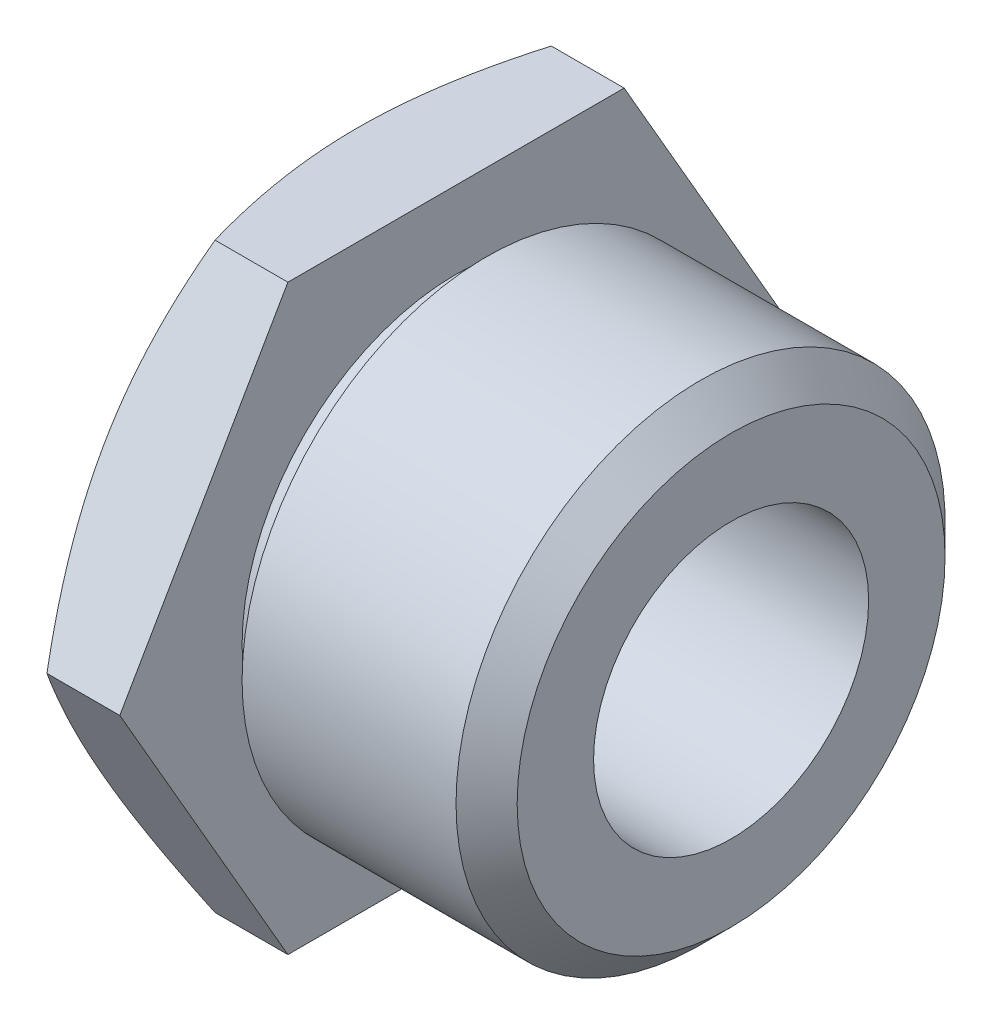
ISO-10303-21;
HEADER;
FILE_DESCRIPTION(('STEP AP214'),'2;1');
FILE_NAME('part.step','',(''),(''),'','','');
FILE_SCHEMA(('AUTOMOTIVE_DESIGN { 1 0 10303 214 1 1 1 1 }'));
ENDSEC;
DATA;
#1=APPLICATION_CONTEXT('core data for automotive mechanical design processes');
#2=APPLICATION_PROTOCOL_DEFINITION('international standard','automotive_design',2000,#1);
#3=PRODUCT_CONTEXT('',#1,'mechanical');
#4=PRODUCT('Part','Part','',(#3));
#5=PRODUCT_RELATED_PRODUCT_CATEGORY('part','',(#4));
#6=PRODUCT_DEFINITION_FORMATION('','',#4);
#7=PRODUCT_DEFINITION_CONTEXT('part definition',#1,'design');
#8=PRODUCT_DEFINITION('design','',#6,#7);
#9=PRODUCT_DEFINITION_SHAPE('','',#8);
#10=(LENGTH_UNIT() NAMED_UNIT(*) SI_UNIT(.MILLI.,.METRE.));
#11=(NAMED_UNIT(*) PLANE_ANGLE_UNIT() SI_UNIT($,.RADIAN.));
#12=(NAMED_UNIT(*) SI_UNIT($,.STERADIAN.) SOLID_ANGLE_UNIT());
#13=UNCERTAINTY_MEASURE_WITH_UNIT(LENGTH_MEASURE(1.E-05),#10,'distance_accuracy_value','');
#14=(GEOMETRIC_REPRESENTATION_CONTEXT(3) GLOBAL_UNCERTAINTY_ASSIGNED_CONTEXT((#13)) GLOBAL_UNIT_ASSIGNED_CONTEXT((#10,
#11,#12)) REPRESENTATION_CONTEXT('',''));
#15=CARTESIAN_POINT('',(0.,0.,0.));
#16=DIRECTION('',(0.,0.,1.));
#17=DIRECTION('',(1.,0.,0.));
#18=AXIS2_PLACEMENT_3D('',#15,#16,#17);
#19=CARTESIAN_POINT('',(0.,0.,0.));
#20=DIRECTION('',(-1.,0.,0.));
#21=DIRECTION('',(0.,0.,1.));
#22=AXIS2_PLACEMENT_3D('',#19,#20,#21);
#23=CYLINDRICAL_SURFACE('',#22,14.);
#24=CARTESIAN_POINT('',(0.,0.,0.));
#25=DIRECTION('',(-1.,0.,0.));
#26=DIRECTION('',(0.,0.,1.));
#27=AXIS2_PLACEMENT_3D('',#24,#25,#26);
#28=CIRCLE('',#27,14.);
#29=CARTESIAN_POINT('',(0.,0.,14.));
#30=VERTEX_POINT('',#29);
#31=EDGE_CURVE('E448',#30,#30,#28,.T.);
#32=ORIENTED_EDGE('',*,*,#31,.F.);
#33=EDGE_LOOP('',(#32));
#34=FACE_BOUND('',#33,.T.);
#35=CARTESIAN_POINT('',(2.,0.,0.));
#36=DIRECTION('',(-1.,0.,0.));
#37=DIRECTION('',(0.,0.,1.));
#38=AXIS2_PLACEMENT_3D('',#35,#36,#37);
#39=CIRCLE('',#38,14.);
#40=CARTESIAN_POINT('',(2.,0.,14.));
#41=VERTEX_POINT('',#40);
#42=EDGE_CURVE('E445',#41,#41,#39,.T.);
#43=ORIENTED_EDGE('',*,*,#42,.T.);
#44=EDGE_LOOP('',(#43));
#45=FACE_BOUND('',#44,.T.);
#46=ADVANCED_FACE('F352',(#34,#45),#23,.T.);
#47=CARTESIAN_POINT('',(2.,14.,0.));
#48=DIRECTION('',(1.,0.,0.));
#49=DIRECTION('',(0.,0.,-1.));
#50=AXIS2_PLACEMENT_3D('',#47,#48,#49);
#51=PLANE('',#50);
#52=ORIENTED_EDGE('',*,*,#42,.F.);
#53=EDGE_LOOP('',(#52));
#54=FACE_BOUND('',#53,.T.);
#55=CARTESIAN_POINT('',(2.,0.,0.));
#56=DIRECTION('',(-1.,0.,0.));
#57=DIRECTION('',(0.,0.,1.));
#58=AXIS2_PLACEMENT_3D('',#55,#56,#57);
#59=CIRCLE('',#58,16.);
#60=CARTESIAN_POINT('',(2.,0.,16.));
#61=VERTEX_POINT('',#60);
#62=EDGE_CURVE('E442',#61,#61,#59,.T.);
#63=ORIENTED_EDGE('',*,*,#62,.T.);
#64=EDGE_LOOP('',(#63));
#65=FACE_BOUND('',#64,.T.);
#66=ADVANCED_FACE('F470',(#54,#65),#51,.F.);
#67=CARTESIAN_POINT('',(0.,0.,0.));
#68=DIRECTION('',(-1.,0.,0.));
#69=DIRECTION('',(0.,0.,1.));
#70=AXIS2_PLACEMENT_3D('',#67,#68,#69);
#71=CYLINDRICAL_SURFACE('',#70,16.);
#72=CARTESIAN_POINT('',(16.,0.,0.));
#73=DIRECTION('',(-1.,0.,0.));
#74=DIRECTION('',(0.,0.,1.));
#75=AXIS2_PLACEMENT_3D('',#72,#73,#74);
#76=CIRCLE('',#75,16.);
#77=CARTESIAN_POINT('',(16.,0.,16.));
#78=VERTEX_POINT('',#77);
#79=EDGE_CURVE('E451',#78,#78,#76,.T.);
#80=ORIENTED_EDGE('',*,*,#79,.T.);
#81=EDGE_LOOP('',(#80));
#82=FACE_BOUND('',#81,.T.);
#83=ORIENTED_EDGE('',*,*,#62,.F.);
#84=EDGE_LOOP('',(#83));
#85=FACE_BOUND('',#84,.T.);
#86=ADVANCED_FACE('F467',(#82,#85),#71,.T.);
#87=CARTESIAN_POINT('',(18.,16.,0.));
#88=DIRECTION('',(-1.,0.,0.));
#89=DIRECTION('',(0.,0.,1.));
#90=AXIS2_PLACEMENT_3D('',#87,#88,#89);
#91=PLANE('',#90);
#92=CARTESIAN_POINT('',(18.,0.,0.));
#93=DIRECTION('',(-1.,0.,0.));
#94=DIRECTION('',(0.,0.,1.));
#95=AXIS2_PLACEMENT_3D('',#92,#93,#94);
#96=CIRCLE('',#95,14.);
#97=CARTESIAN_POINT('',(18.,0.,14.));
#98=VERTEX_POINT('',#97);
#99=EDGE_CURVE('E364',#98,#98,#96,.F.);
#100=ORIENTED_EDGE('',*,*,#99,.T.);
#101=EDGE_LOOP('',(#100));
#102=FACE_BOUND('',#101,.T.);
#103=CARTESIAN_POINT('',(18.,0.,0.));
#104=DIRECTION('',(-1.,0.,0.));
#105=DIRECTION('',(0.,0.,1.));
#106=AXIS2_PLACEMENT_3D('',#103,#104,#105);
#107=CIRCLE('',#106,9.);
#108=CARTESIAN_POINT('',(18.,0.,9.));
#109=VERTEX_POINT('',#108);
#110=EDGE_CURVE('E439',#109,#109,#107,.T.);
#111=ORIENTED_EDGE('',*,*,#110,.T.);
#112=EDGE_LOOP('',(#111));
#113=FACE_BOUND('',#112,.T.);
#114=ADVANCED_FACE('F456',(#102,#113),#91,.F.);
#115=CARTESIAN_POINT('',(0.,0.,0.));
#116=DIRECTION('',(-1.,0.,0.));
#117=DIRECTION('',(0.,0.,1.));
#118=AXIS2_PLACEMENT_3D('',#115,#116,#117);
#119=CYLINDRICAL_SURFACE('',#118,9.);
#120=ORIENTED_EDGE('',*,*,#110,.F.);
#121=EDGE_LOOP('',(#120));
#122=FACE_BOUND('',#121,.T.);
#123=CARTESIAN_POINT('',(-6.5,0.,0.));
#124=DIRECTION('',(-1.,0.,0.));
#125=DIRECTION('',(0.,0.,1.));
#126=AXIS2_PLACEMENT_3D('',#123,#124,#125);
#127=CIRCLE('',#126,9.);
#128=CARTESIAN_POINT('',(-6.5,0.,9.));
#129=VERTEX_POINT('',#128);
#130=EDGE_CURVE('E502',#129,#129,#127,.T.);
#131=ORIENTED_EDGE('',*,*,#130,.T.);
#132=EDGE_LOOP('',(#131));
#133=FACE_BOUND('',#132,.T.);
#134=ADVANCED_FACE('F463',(#122,#133),#119,.F.);
#135=CARTESIAN_POINT('',(16.,0.,0.));
#136=DIRECTION('',(-1.,0.,0.));
#137=DIRECTION('',(0.,0.,1.));
#138=AXIS2_PLACEMENT_3D('',#135,#136,#137);
#139=CONICAL_SURFACE('',#138,16.,0.785398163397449);
#140=ORIENTED_EDGE('',*,*,#99,.F.);
#141=EDGE_LOOP('',(#140));
#142=FACE_BOUND('',#141,.T.);
#143=ORIENTED_EDGE('',*,*,#79,.F.);
#144=EDGE_LOOP('',(#143));
#145=FACE_BOUND('',#144,.T.);
#146=ADVANCED_FACE('F459',(#142,#145),#139,.T.);
#147=CARTESIAN_POINT('',(0.,-19.0525588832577,11.));
#148=DIRECTION('',(1.,0.,0.));
#149=DIRECTION('',(0.,0.,-1.));
#150=AXIS2_PLACEMENT_3D('',#147,#148,#149);
#151=PLANE('',#150);
#152=DIRECTION('',(0.,0.866025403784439,0.5));
#153=VECTOR('',#152,1.);
#154=CARTESIAN_POINT('',(0.,-19.0525588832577,11.));
#155=LINE('',#154,#153);
#156=CARTESIAN_POINT('',(0.,-19.0525588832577,11.));
#157=VERTEX_POINT('',#156);
#158=CARTESIAN_POINT('',(0.,0.,22.));
#159=VERTEX_POINT('',#158);
#160=EDGE_CURVE('E555',#157,#159,#155,.T.);
#161=ORIENTED_EDGE('',*,*,#160,.F.);
#162=DIRECTION('',(0.,0.,1.));
#163=VECTOR('',#162,1.);
#164=CARTESIAN_POINT('',(0.,-19.0525588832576,-11.));
#165=LINE('',#164,#163);
#166=CARTESIAN_POINT('',(0.,-19.0525588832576,-11.));
#167=VERTEX_POINT('',#166);
#168=EDGE_CURVE('E568',#167,#157,#165,.T.);
#169=ORIENTED_EDGE('',*,*,#168,.F.);
#170=DIRECTION('',(0.,-0.866025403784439,0.5));
#171=VECTOR('',#170,1.);
#172=CARTESIAN_POINT('',(0.,0.,-22.));
#173=LINE('',#172,#171);
#174=CARTESIAN_POINT('',(0.,0.,-22.));
#175=VERTEX_POINT('',#174);
#176=EDGE_CURVE('E566',#175,#167,#173,.T.);
#177=ORIENTED_EDGE('',*,*,#176,.F.);
#178=DIRECTION('',(0.,-0.866025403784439,-0.5));
#179=VECTOR('',#178,1.);
#180=CARTESIAN_POINT('',(0.,19.0525588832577,-11.));
#181=LINE('',#180,#179);
#182=CARTESIAN_POINT('',(0.,19.0525588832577,-11.));
#183=VERTEX_POINT('',#182);
#184=EDGE_CURVE('E427',#183,#175,#181,.T.);
#185=ORIENTED_EDGE('',*,*,#184,.F.);
#186=DIRECTION('',(0.,0.,-1.));
#187=VECTOR('',#186,1.);
#188=CARTESIAN_POINT('',(0.,19.0525588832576,11.));
#189=LINE('',#188,#187);
#190=CARTESIAN_POINT('',(0.,19.0525588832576,11.));
#191=VERTEX_POINT('',#190);
#192=EDGE_CURVE('E560',#191,#183,#189,.T.);
#193=ORIENTED_EDGE('',*,*,#192,.F.);
#194=DIRECTION('',(0.,0.866025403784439,-0.5));
#195=VECTOR('',#194,1.);
#196=CARTESIAN_POINT('',(0.,0.,22.));
#197=LINE('',#196,#195);
#198=EDGE_CURVE('E556',#159,#191,#197,.T.);
#199=ORIENTED_EDGE('',*,*,#198,.F.);
#200=EDGE_LOOP('',(#161,#169,#177,#185,#193,#199));
#201=FACE_BOUND('',#200,.T.);
#202=ORIENTED_EDGE('',*,*,#31,.T.);
#203=EDGE_LOOP('',(#202));
#204=FACE_BOUND('',#203,.T.);
#205=ADVANCED_FACE('F462',(#201,#204),#151,.T.);
#206=CARTESIAN_POINT('',(-6.5,-19.0525588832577,11.));
#207=DIRECTION('',(1.,0.,0.));
#208=DIRECTION('',(0.,0.,-1.));
#209=AXIS2_PLACEMENT_3D('',#206,#207,#208);
#210=PLANE('',#209);
#211=CARTESIAN_POINT('',(-6.5,0.,0.));
#212=DIRECTION('',(1.,0.,0.));
#213=DIRECTION('',(0.,0.,-1.));
#214=AXIS2_PLACEMENT_3D('',#211,#212,#213);
#215=CIRCLE('',#214,19.);
#216=CARTESIAN_POINT('',(-6.5,0.,-19.));
#217=VERTEX_POINT('',#216);
#218=EDGE_CURVE('E423',#217,#217,#215,.T.);
#219=ORIENTED_EDGE('',*,*,#218,.F.);
#220=EDGE_LOOP('',(#219));
#221=FACE_BOUND('',#220,.T.);
#222=ORIENTED_EDGE('',*,*,#130,.F.);
#223=EDGE_LOOP('',(#222));
#224=FACE_BOUND('',#223,.T.);
#225=ADVANCED_FACE('F492',(#221,#224),#210,.F.);
#226=CARTESIAN_POINT('',(-6.5,-19.0525588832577,11.));
#227=DIRECTION('',(0.,0.5,-0.866025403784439));
#228=DIRECTION('',(0.,0.866025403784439,0.5));
#229=AXIS2_PLACEMENT_3D('',#226,#227,#228);
#230=PLANE('',#229);
#231=DIRECTION('',(1.,0.,0.));
#232=VECTOR('',#231,1.);
#233=CARTESIAN_POINT('',(-6.5,0.,22.));
#234=LINE('',#233,#232);
#235=CARTESIAN_POINT('',(-4.76794919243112,0.,22.));
#236=VERTEX_POINT('',#235);
#237=EDGE_CURVE('E437',#236,#159,#234,.T.);
#238=ORIENTED_EDGE('',*,*,#237,.F.);
#239=CARTESIAN_POINT('',(-4.76788252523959,0.000199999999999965,22.0001154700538));
#240=CARTESIAN_POINT('',(-4.90746189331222,-0.418567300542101,21.758340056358));
#241=CARTESIAN_POINT('',(-5.04070736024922,-0.83896801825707,21.5156215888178));
#242=CARTESIAN_POINT('',(-5.29276989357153,-1.68314056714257,21.0282383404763));
#243=CARTESIAN_POINT('',(-5.41158221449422,-2.10691345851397,20.7835729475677));
#244=CARTESIAN_POINT('',(-5.63318137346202,-2.95864937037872,20.2918229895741));
#245=CARTESIAN_POINT('',(-5.73593029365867,-3.38661984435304,20.0447341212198));
#246=CARTESIAN_POINT('',(-5.92319629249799,-4.24553455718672,19.5488394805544));
#247=CARTESIAN_POINT('',(-6.00771441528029,-4.67647862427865,19.3000338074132));
#248=CARTESIAN_POINT('',(-6.15492402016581,-5.53029829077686,18.807080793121));
#249=CARTESIAN_POINT('',(-6.21810274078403,-5.95311050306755,18.5629700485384));
#250=CARTESIAN_POINT('',(-6.3240392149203,-6.8006723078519,18.0736300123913));
#251=CARTESIAN_POINT('',(-6.36679657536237,-7.22542193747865,17.8284006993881));
#252=CARTESIAN_POINT('',(-6.43081073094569,-8.07563469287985,17.3375301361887));
#253=CARTESIAN_POINT('',(-6.45209307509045,-8.50109636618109,17.0918897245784));
#254=CARTESIAN_POINT('',(-6.47269950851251,-9.35241242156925,16.6003821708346));
#255=CARTESIAN_POINT('',(-6.47202427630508,-9.77826679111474,16.3545150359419));
#256=CARTESIAN_POINT('',(-6.45024910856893,-10.5744105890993,15.8948611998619));
#257=CARTESIAN_POINT('',(-6.43180446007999,-10.9447567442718,15.6810417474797));
#258=CARTESIAN_POINT('',(-6.37865846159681,-11.6845656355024,15.2539128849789));
#259=CARTESIAN_POINT('',(-6.34395734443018,-12.0540283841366,15.0406034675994));
#260=CARTESIAN_POINT('',(-6.25890053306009,-12.7919304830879,14.6145754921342));
#261=CARTESIAN_POINT('',(-6.20853068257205,-13.1603686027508,14.4018576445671));
#262=CARTESIAN_POINT('',(-6.09302522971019,-13.8954909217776,13.9774345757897));
#263=CARTESIAN_POINT('',(-6.02788968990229,-14.2621751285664,13.7657293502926));
#264=CARTESIAN_POINT('',(-5.80867794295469,-15.3752922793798,13.1230708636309));
#265=CARTESIAN_POINT('',(-5.63274354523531,-16.1185017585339,12.693978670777));
#266=CARTESIAN_POINT('',(-5.23344474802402,-17.5938387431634,11.8421924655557));
#267=CARTESIAN_POINT('',(-5.01017412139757,-18.3259851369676,11.4194875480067));
#268=CARTESIAN_POINT('',(-4.76788252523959,-19.0527588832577,10.9998845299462));
#269=B_SPLINE_CURVE_WITH_KNOTS('',3,(#239,#240,#241,#242,#243,#244,#245,#246,#247,#248,#249,
#250,#251,#252,#253,#254,#255,#256,#257,#258,#259,#260,#261,#262,#263,#264,#265,#266,#267,#268),
.UNSPECIFIED.,.F.,.F.,(4,2,2,2,2,2,2,2,2,2,2,2,2,2,4),(0.,1.50991838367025,3.02033187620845,
4.53425856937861,6.04809853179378,7.5245737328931,9.00107735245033,10.4758222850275,
11.9505216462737,13.2343215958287,14.5181031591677,15.8030479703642,17.0879873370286,
19.71446609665,22.335789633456),.UNSPECIFIED.);
#270=CARTESIAN_POINT('',(-4.76794919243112,-19.0525588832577,11.));
#271=VERTEX_POINT('',#270);
#272=EDGE_CURVE('E496',#236,#271,#269,.T.);
#273=ORIENTED_EDGE('',*,*,#272,.T.);
#274=DIRECTION('',(1.,0.,0.));
#275=VECTOR('',#274,1.);
#276=CARTESIAN_POINT('',(-6.5,-19.0525588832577,11.));
#277=LINE('',#276,#275);
#278=EDGE_CURVE('E378',#271,#157,#277,.T.);
#279=ORIENTED_EDGE('',*,*,#278,.T.);
#280=ORIENTED_EDGE('',*,*,#160,.T.);
#281=EDGE_LOOP('',(#238,#273,#279,#280));
#282=FACE_BOUND('',#281,.T.);
#283=ADVANCED_FACE('F487',(#282),#230,.F.);
#284=CARTESIAN_POINT('',(-6.5,0.,22.));
#285=DIRECTION('',(0.,-0.5,-0.866025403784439));
#286=DIRECTION('',(0.,0.866025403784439,-0.5));
#287=AXIS2_PLACEMENT_3D('',#284,#285,#286);
#288=PLANE('',#287);
#289=DIRECTION('',(1.,0.,0.));
#290=VECTOR('',#289,1.);
#291=CARTESIAN_POINT('',(-6.5,19.0525588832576,11.));
#292=LINE('',#291,#290);
#293=CARTESIAN_POINT('',(-4.76794919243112,19.0525588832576,11.));
#294=VERTEX_POINT('',#293);
#295=EDGE_CURVE('E431',#294,#191,#292,.T.);
#296=ORIENTED_EDGE('',*,*,#295,.F.);
#297=CARTESIAN_POINT('',(-4.76788252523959,19.0527588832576,10.9998845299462));
#298=CARTESIAN_POINT('',(-4.90746189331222,18.6339915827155,11.241659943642));
#299=CARTESIAN_POINT('',(-5.04070736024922,18.2135908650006,11.4843784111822));
#300=CARTESIAN_POINT('',(-5.29276989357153,17.3694183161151,11.9717616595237));
#301=CARTESIAN_POINT('',(-5.41158221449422,16.9456454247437,12.2164270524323));
#302=CARTESIAN_POINT('',(-5.63318137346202,16.0939095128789,12.7081770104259));
#303=CARTESIAN_POINT('',(-5.73593029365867,15.6659390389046,12.9552658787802));
#304=CARTESIAN_POINT('',(-5.92319629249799,14.8070243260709,13.4511605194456));
#305=CARTESIAN_POINT('',(-6.00771441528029,14.376080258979,13.6999661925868));
#306=CARTESIAN_POINT('',(-6.15492402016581,13.5222605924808,14.1929192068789));
#307=CARTESIAN_POINT('',(-6.21810274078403,13.0994483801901,14.4370299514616));
#308=CARTESIAN_POINT('',(-6.3240392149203,12.2518865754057,14.9263699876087));
#309=CARTESIAN_POINT('',(-6.36679657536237,11.827136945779,15.1715993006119));
#310=CARTESIAN_POINT('',(-6.43081073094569,10.9769241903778,15.6624698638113));
#311=CARTESIAN_POINT('',(-6.45209307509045,10.5514625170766,15.9081102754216));
#312=CARTESIAN_POINT('',(-6.47269950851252,9.7001464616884,16.3996178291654));
#313=CARTESIAN_POINT('',(-6.47202427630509,9.27429209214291,16.6454849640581));
#314=CARTESIAN_POINT('',(-6.45024910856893,8.47814829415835,17.1051388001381));
#315=CARTESIAN_POINT('',(-6.43180446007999,8.10780213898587,17.3189582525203));
#316=CARTESIAN_POINT('',(-6.37865846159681,7.3679932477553,17.7460871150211));
#317=CARTESIAN_POINT('',(-6.34395734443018,6.99853049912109,17.9593965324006));
#318=CARTESIAN_POINT('',(-6.25890053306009,6.26062840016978,18.3854245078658));
#319=CARTESIAN_POINT('',(-6.20853068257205,5.89219028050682,18.5981423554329));
#320=CARTESIAN_POINT('',(-6.09302522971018,5.15706796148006,19.0225654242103));
#321=CARTESIAN_POINT('',(-6.02788968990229,4.79038375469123,19.2342706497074));
#322=CARTESIAN_POINT('',(-5.80867794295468,3.67726660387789,19.8769291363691));
#323=CARTESIAN_POINT('',(-5.63274354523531,2.93405712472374,20.306021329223));
#324=CARTESIAN_POINT('',(-5.23344474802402,1.45872014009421,21.1578075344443));
#325=CARTESIAN_POINT('',(-5.01017412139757,0.72657374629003,21.5805124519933));
#326=CARTESIAN_POINT('',(-4.76788252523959,-0.000200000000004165,22.0001154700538));
#327=B_SPLINE_CURVE_WITH_KNOTS('',3,(#297,#298,#299,#300,#301,#302,#303,#304,#305,#306,#307,
#308,#309,#310,#311,#312,#313,#314,#315,#316,#317,#318,#319,#320,#321,#322,#323,#324,#325,#326),
.UNSPECIFIED.,.F.,.F.,(4,2,2,2,2,2,2,2,2,2,2,2,2,2,4),(0.,1.50991838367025,3.02033187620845,
4.53425856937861,6.04809853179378,7.5245737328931,9.00107735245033,10.4758222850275,
11.9505216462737,13.2343215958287,14.5181031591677,15.8030479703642,17.0879873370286,
19.71446609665,22.335789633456),.UNSPECIFIED.);
#328=EDGE_CURVE('E503',#294,#236,#327,.T.);
#329=ORIENTED_EDGE('',*,*,#328,.T.);
#330=ORIENTED_EDGE('',*,*,#237,.T.);
#331=ORIENTED_EDGE('',*,*,#198,.T.);
#332=EDGE_LOOP('',(#296,#329,#330,#331));
#333=FACE_BOUND('',#332,.T.);
#334=ADVANCED_FACE('F491',(#333),#288,.F.);
#335=CARTESIAN_POINT('',(-6.5,19.0525588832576,11.));
#336=DIRECTION('',(0.,-1.,0.));
#337=DIRECTION('',(0.,0.,-1.));
#338=AXIS2_PLACEMENT_3D('',#335,#336,#337);
#339=PLANE('',#338);
#340=DIRECTION('',(1.,0.,0.));
#341=VECTOR('',#340,1.);
#342=CARTESIAN_POINT('',(-6.5,19.0525588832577,-11.));
#343=LINE('',#342,#341);
#344=CARTESIAN_POINT('',(-4.76794919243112,19.0525588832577,-11.));
#345=VERTEX_POINT('',#344);
#346=EDGE_CURVE('E429',#345,#183,#343,.T.);
#347=ORIENTED_EDGE('',*,*,#346,.F.);
#348=CARTESIAN_POINT('',(2.64546870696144,19.0525588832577,-29.1694123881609));
#349=CARTESIAN_POINT('',(2.44331336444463,19.0525588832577,-28.75118676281));
#350=CARTESIAN_POINT('',(2.24220460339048,19.0525588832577,-28.3324555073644));
#351=CARTESIAN_POINT('',(1.84232048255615,19.0525588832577,-27.4938749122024));
#352=CARTESIAN_POINT('',(1.64354514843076,19.0525588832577,-27.0740255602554));
#353=CARTESIAN_POINT('',(1.05102203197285,19.0525588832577,-25.8125171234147));
#354=CARTESIAN_POINT('',(0.661143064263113,19.0525588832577,-24.9690336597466));
#355=CARTESIAN_POINT('',(-0.108011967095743,19.0525588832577,-23.2714077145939));
#356=CARTESIAN_POINT('',(-0.487214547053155,19.0525588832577,-22.417231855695));
#357=CARTESIAN_POINT('',(-1.22933247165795,19.0525588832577,-20.7018588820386));
#358=CARTESIAN_POINT('',(-1.59224866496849,19.0525588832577,-19.8406621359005));
#359=CARTESIAN_POINT('',(-2.30175286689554,19.0525588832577,-18.0992065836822));
#360=CARTESIAN_POINT('',(-2.64808629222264,19.0525588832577,-17.2188435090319));
#361=CARTESIAN_POINT('',(-3.31361905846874,19.0525588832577,-15.447725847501));
#362=CARTESIAN_POINT('',(-3.63281538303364,19.0525588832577,-14.5569701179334));
#363=CARTESIAN_POINT('',(-4.23548985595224,19.0525588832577,-12.7655102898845));
#364=CARTESIAN_POINT('',(-4.51904398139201,19.0525588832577,-11.8648319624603));
#365=CARTESIAN_POINT('',(-5.04123644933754,19.0525588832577,-10.0505840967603));
#366=CARTESIAN_POINT('',(-5.27988898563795,19.0525588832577,-9.13701873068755));
#367=CARTESIAN_POINT('',(-5.59545336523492,19.0525588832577,-7.75683148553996));
#368=CARTESIAN_POINT('',(-5.69358872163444,19.0525588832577,-7.2950302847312));
#369=CARTESIAN_POINT('',(-5.8741711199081,19.0525588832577,-6.36835518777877));
#370=CARTESIAN_POINT('',(-5.95661851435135,19.0525588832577,-5.90348136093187));
#371=CARTESIAN_POINT('',(-6.10436307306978,19.0525588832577,-4.97097332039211));
#372=CARTESIAN_POINT('',(-6.16965918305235,19.0525588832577,-4.50333893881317));
#373=CARTESIAN_POINT('',(-6.28178954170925,19.0525588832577,-3.56584597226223));
#374=CARTESIAN_POINT('',(-6.32862376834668,19.0525588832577,-3.09598738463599));
#375=CARTESIAN_POINT('',(-6.40256975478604,19.0525588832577,-2.15771150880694));
#376=CARTESIAN_POINT('',(-6.42980481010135,19.0525588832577,-1.68930400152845));
#377=CARTESIAN_POINT('',(-6.46440933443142,19.0525588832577,-0.751758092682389));
#378=CARTESIAN_POINT('',(-6.47177910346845,19.0525588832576,-0.282619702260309));
#379=CARTESIAN_POINT('',(-6.4664782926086,19.0525588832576,0.655416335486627));
#380=CARTESIAN_POINT('',(-6.45381325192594,19.0525588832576,1.12431401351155));
#381=CARTESIAN_POINT('',(-6.40875761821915,19.0525588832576,2.06116274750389));
#382=CARTESIAN_POINT('',(-6.37636615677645,19.0525588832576,2.52911376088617));
#383=CARTESIAN_POINT('',(-6.27464712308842,19.0525588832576,3.66307564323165));
#384=CARTESIAN_POINT('',(-6.19544828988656,19.0525588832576,4.32821828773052));
#385=CARTESIAN_POINT('',(-6.00160677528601,19.0525588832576,5.65329011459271));
#386=CARTESIAN_POINT('',(-5.88695883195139,19.0525588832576,6.31321850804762));
#387=CARTESIAN_POINT('',(-5.49559206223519,19.0525588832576,8.28633499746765));
#388=CARTESIAN_POINT('',(-5.171710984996,19.0525588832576,9.59027651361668));
#389=CARTESIAN_POINT('',(-4.61326854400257,19.0525588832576,11.5407469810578));
#390=CARTESIAN_POINT('',(-4.41228629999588,19.0525588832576,12.197467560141));
#391=CARTESIAN_POINT('',(-3.99029194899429,19.0525588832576,13.5045641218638));
#392=CARTESIAN_POINT('',(-3.76927803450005,19.0525588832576,14.1549395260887));
#393=CARTESIAN_POINT('',(-3.31192892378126,19.0525588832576,15.4461037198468));
#394=CARTESIAN_POINT('',(-3.07568717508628,19.0525588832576,16.0869258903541));
#395=CARTESIAN_POINT('',(-2.71110064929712,19.0525588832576,17.044123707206));
#396=CARTESIAN_POINT('',(-2.58788868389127,19.0525588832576,17.3624656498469));
#397=CARTESIAN_POINT('',(-2.33833339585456,19.0525588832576,17.99791303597));
#398=CARTESIAN_POINT('',(-2.21199013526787,19.0525588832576,18.3150185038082));
#399=CARTESIAN_POINT('',(-2.08422255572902,19.0525588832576,18.6315486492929));
#400=B_SPLINE_CURVE_WITH_KNOTS('',3,(#348,#349,#350,#351,#352,#353,#354,#355,#356,#357,#358,
#359,#360,#361,#362,#363,#364,#365,#366,#367,#368,#369,#370,#371,#372,#373,#374,#375,#376,#377,
#378,#379,#380,#381,#382,#383,#384,#385,#386,#387,#388,#389,#390,#391,#392,#393,#394,#395,#396,
#397,#398,#399),.UNSPECIFIED.,.F.,.F.,(4,2,2,2,2,2,2,2,2,2,2,2,2,2,2,2,2,2,2,2,2,2,2,2,2,4),(0.,
1.39355930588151,2.78713391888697,5.57473653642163,8.37829883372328,11.1817148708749,
14.0194841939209,16.8575685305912,19.6894965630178,22.5205278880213,23.9366439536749,
25.3527281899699,26.7688994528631,28.1850724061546,29.5922566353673,30.9994196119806,
32.4061936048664,33.8130295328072,35.8214120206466,37.8300927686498,41.8551927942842,
43.9153909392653,45.975775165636,48.0245382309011,49.0485868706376,50.0726152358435),.UNSPECIFIED.);
#401=EDGE_CURVE('E411',#345,#294,#400,.T.);
#402=ORIENTED_EDGE('',*,*,#401,.T.);
#403=ORIENTED_EDGE('',*,*,#295,.T.);
#404=ORIENTED_EDGE('',*,*,#192,.T.);
#405=EDGE_LOOP('',(#347,#402,#403,#404));
#406=FACE_BOUND('',#405,.T.);
#407=ADVANCED_FACE('F532',(#406),#339,.F.);
#408=CARTESIAN_POINT('',(-6.5,19.0525588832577,-11.));
#409=DIRECTION('',(0.,-0.5,0.866025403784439));
#410=DIRECTION('',(0.,-0.866025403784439,-0.5));
#411=AXIS2_PLACEMENT_3D('',#408,#409,#410);
#412=PLANE('',#411);
#413=DIRECTION('',(1.,0.,0.));
#414=VECTOR('',#413,1.);
#415=CARTESIAN_POINT('',(-6.5,0.,-22.));
#416=LINE('',#415,#414);
#417=CARTESIAN_POINT('',(-4.76794919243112,0.,-22.));
#418=VERTEX_POINT('',#417);
#419=EDGE_CURVE('E420',#418,#175,#416,.T.);
#420=ORIENTED_EDGE('',*,*,#419,.F.);
#421=CARTESIAN_POINT('',(-4.76788252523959,-0.000199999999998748,-22.0001154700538));
#422=CARTESIAN_POINT('',(-4.90746189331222,0.418567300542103,-21.758340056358));
#423=CARTESIAN_POINT('',(-5.04070736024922,0.838968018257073,-21.5156215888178));
#424=CARTESIAN_POINT('',(-5.29276989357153,1.68314056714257,-21.0282383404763));
#425=CARTESIAN_POINT('',(-5.41158221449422,2.10691345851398,-20.7835729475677));
#426=CARTESIAN_POINT('',(-5.63318137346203,2.95864937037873,-20.2918229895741));
#427=CARTESIAN_POINT('',(-5.73593029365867,3.38661984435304,-20.0447341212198));
#428=CARTESIAN_POINT('',(-5.92319629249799,4.24553455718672,-19.5488394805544));
#429=CARTESIAN_POINT('',(-6.00771441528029,4.67647862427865,-19.3000338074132));
#430=CARTESIAN_POINT('',(-6.15492402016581,5.53029829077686,-18.807080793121));
#431=CARTESIAN_POINT('',(-6.21810274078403,5.95311050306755,-18.5629700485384));
#432=CARTESIAN_POINT('',(-6.3240392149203,6.8006723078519,-18.0736300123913));
#433=CARTESIAN_POINT('',(-6.36679657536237,7.22542193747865,-17.8284006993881));
#434=CARTESIAN_POINT('',(-6.4308107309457,8.07563469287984,-17.3375301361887));
#435=CARTESIAN_POINT('',(-6.45209307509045,8.50109636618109,-17.0918897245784));
#436=CARTESIAN_POINT('',(-6.47269950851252,9.35241242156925,-16.6003821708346));
#437=CARTESIAN_POINT('',(-6.47202427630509,9.77826679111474,-16.3545150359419));
#438=CARTESIAN_POINT('',(-6.45024910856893,10.5744105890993,-15.8948611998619));
#439=CARTESIAN_POINT('',(-6.43180446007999,10.9447567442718,-15.6810417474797));
#440=CARTESIAN_POINT('',(-6.37865846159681,11.6845656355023,-15.2539128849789));
#441=CARTESIAN_POINT('',(-6.34395734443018,12.0540283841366,-15.0406034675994));
#442=CARTESIAN_POINT('',(-6.25890053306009,12.7919304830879,-14.6145754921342));
#443=CARTESIAN_POINT('',(-6.20853068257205,13.1603686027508,-14.4018576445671));
#444=CARTESIAN_POINT('',(-6.09302522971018,13.8954909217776,-13.9774345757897));
#445=CARTESIAN_POINT('',(-6.02788968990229,14.2621751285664,-13.7657293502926));
#446=CARTESIAN_POINT('',(-5.80867794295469,15.3752922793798,-13.1230708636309));
#447=CARTESIAN_POINT('',(-5.63274354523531,16.1185017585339,-12.693978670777));
#448=CARTESIAN_POINT('',(-5.23344474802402,17.5938387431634,-11.8421924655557));
#449=CARTESIAN_POINT('',(-5.01017412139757,18.3259851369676,-11.4194875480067));
#450=CARTESIAN_POINT('',(-4.76788252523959,19.0527588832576,-10.9998845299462));
#451=B_SPLINE_CURVE_WITH_KNOTS('',3,(#421,#422,#423,#424,#425,#426,#427,#428,#429,#430,#431,
#432,#433,#434,#435,#436,#437,#438,#439,#440,#441,#442,#443,#444,#445,#446,#447,#448,#449,#450),
.UNSPECIFIED.,.F.,.F.,(4,2,2,2,2,2,2,2,2,2,2,2,2,2,4),(0.,1.50991838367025,3.02033187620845,
4.53425856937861,6.04809853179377,7.5245737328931,9.00107735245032,10.4758222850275,
11.9505216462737,13.2343215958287,14.5181031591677,15.8030479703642,17.0879873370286,
19.71446609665,22.335789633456),.UNSPECIFIED.);
#452=EDGE_CURVE('E408',#418,#345,#451,.T.);
#453=ORIENTED_EDGE('',*,*,#452,.T.);
#454=ORIENTED_EDGE('',*,*,#346,.T.);
#455=ORIENTED_EDGE('',*,*,#184,.T.);
#456=EDGE_LOOP('',(#420,#453,#454,#455));
#457=FACE_BOUND('',#456,.T.);
#458=ADVANCED_FACE('F425',(#457),#412,.F.);
#459=CARTESIAN_POINT('',(-6.5,0.,-22.));
#460=DIRECTION('',(0.,0.5,0.866025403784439));
#461=DIRECTION('',(0.,-0.866025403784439,0.5));
#462=AXIS2_PLACEMENT_3D('',#459,#460,#461);
#463=PLANE('',#462);
#464=DIRECTION('',(1.,0.,0.));
#465=VECTOR('',#464,1.);
#466=CARTESIAN_POINT('',(-6.5,-19.0525588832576,-11.));
#467=LINE('',#466,#465);
#468=CARTESIAN_POINT('',(-4.76794919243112,-19.0525588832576,-11.));
#469=VERTEX_POINT('',#468);
#470=EDGE_CURVE('E422',#469,#167,#467,.T.);
#471=ORIENTED_EDGE('',*,*,#470,.F.);
#472=CARTESIAN_POINT('',(-4.76788252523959,-19.0527588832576,-10.9998845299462));
#473=CARTESIAN_POINT('',(-4.90746189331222,-18.6339915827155,-11.241659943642));
#474=CARTESIAN_POINT('',(-5.04070736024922,-18.2135908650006,-11.4843784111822));
#475=CARTESIAN_POINT('',(-5.29276989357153,-17.3694183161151,-11.9717616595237));
#476=CARTESIAN_POINT('',(-5.41158221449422,-16.9456454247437,-12.2164270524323));
#477=CARTESIAN_POINT('',(-5.63318137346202,-16.0939095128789,-12.7081770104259));
#478=CARTESIAN_POINT('',(-5.73593029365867,-15.6659390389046,-12.9552658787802));
#479=CARTESIAN_POINT('',(-5.92319629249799,-14.8070243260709,-13.4511605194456));
#480=CARTESIAN_POINT('',(-6.00771441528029,-14.376080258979,-13.6999661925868));
#481=CARTESIAN_POINT('',(-6.15492402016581,-13.5222605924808,-14.1929192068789));
#482=CARTESIAN_POINT('',(-6.21810274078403,-13.0994483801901,-14.4370299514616));
#483=CARTESIAN_POINT('',(-6.3240392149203,-12.2518865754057,-14.9263699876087));
#484=CARTESIAN_POINT('',(-6.36679657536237,-11.827136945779,-15.1715993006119));
#485=CARTESIAN_POINT('',(-6.43081073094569,-10.9769241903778,-15.6624698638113));
#486=CARTESIAN_POINT('',(-6.45209307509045,-10.5514625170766,-15.9081102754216));
#487=CARTESIAN_POINT('',(-6.47269950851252,-9.7001464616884,-16.3996178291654));
#488=CARTESIAN_POINT('',(-6.47202427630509,-9.27429209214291,-16.6454849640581));
#489=CARTESIAN_POINT('',(-6.45024910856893,-8.47814829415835,-17.1051388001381));
#490=CARTESIAN_POINT('',(-6.43180446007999,-8.10780213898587,-17.3189582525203));
#491=CARTESIAN_POINT('',(-6.37865846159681,-7.3679932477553,-17.7460871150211));
#492=CARTESIAN_POINT('',(-6.34395734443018,-6.99853049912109,-17.9593965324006));
#493=CARTESIAN_POINT('',(-6.25890053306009,-6.26062840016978,-18.3854245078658));
#494=CARTESIAN_POINT('',(-6.20853068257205,-5.89219028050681,-18.5981423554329));
#495=CARTESIAN_POINT('',(-6.09302522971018,-5.15706796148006,-19.0225654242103));
#496=CARTESIAN_POINT('',(-6.02788968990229,-4.79038375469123,-19.2342706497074));
#497=CARTESIAN_POINT('',(-5.80867794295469,-3.67726660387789,-19.8769291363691));
#498=CARTESIAN_POINT('',(-5.63274354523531,-2.93405712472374,-20.306021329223));
#499=CARTESIAN_POINT('',(-5.23344474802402,-1.45872014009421,-21.1578075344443));
#500=CARTESIAN_POINT('',(-5.01017412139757,-0.726573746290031,-21.5805124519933));
#501=CARTESIAN_POINT('',(-4.76788252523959,0.000200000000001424,-22.0001154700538));
#502=B_SPLINE_CURVE_WITH_KNOTS('',3,(#472,#473,#474,#475,#476,#477,#478,#479,#480,#481,#482,
#483,#484,#485,#486,#487,#488,#489,#490,#491,#492,#493,#494,#495,#496,#497,#498,#499,#500,#501),
.UNSPECIFIED.,.F.,.F.,(4,2,2,2,2,2,2,2,2,2,2,2,2,2,4),(0.,1.50991838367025,3.02033187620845,
4.53425856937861,6.04809853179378,7.5245737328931,9.00107735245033,10.4758222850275,
11.9505216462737,13.2343215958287,14.5181031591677,15.8030479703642,17.0879873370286,
19.71446609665,22.335789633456),.UNSPECIFIED.);
#503=EDGE_CURVE('E371',#469,#418,#502,.T.);
#504=ORIENTED_EDGE('',*,*,#503,.T.);
#505=ORIENTED_EDGE('',*,*,#419,.T.);
#506=ORIENTED_EDGE('',*,*,#176,.T.);
#507=EDGE_LOOP('',(#471,#504,#505,#506));
#508=FACE_BOUND('',#507,.T.);
#509=ADVANCED_FACE('F418',(#508),#463,.F.);
#510=CARTESIAN_POINT('',(-6.5,-19.0525588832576,-11.));
#511=DIRECTION('',(0.,1.,0.));
#512=DIRECTION('',(0.,0.,1.));
#513=AXIS2_PLACEMENT_3D('',#510,#511,#512);
#514=PLANE('',#513);
#515=ORIENTED_EDGE('',*,*,#278,.F.);
#516=CARTESIAN_POINT('',(2.64546870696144,-19.0525588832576,-29.1694123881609));
#517=CARTESIAN_POINT('',(2.44331336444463,-19.0525588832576,-28.7511867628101));
#518=CARTESIAN_POINT('',(2.24220460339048,-19.0525588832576,-28.3324555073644));
#519=CARTESIAN_POINT('',(1.84232048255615,-19.0525588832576,-27.4938749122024));
#520=CARTESIAN_POINT('',(1.64354514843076,-19.0525588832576,-27.0740255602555));
#521=CARTESIAN_POINT('',(1.05102203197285,-19.0525588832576,-25.8125171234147));
#522=CARTESIAN_POINT('',(0.661143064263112,-19.0525588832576,-24.9690336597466));
#523=CARTESIAN_POINT('',(-0.108011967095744,-19.0525588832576,-23.2714077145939));
#524=CARTESIAN_POINT('',(-0.487214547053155,-19.0525588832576,-22.417231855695));
#525=CARTESIAN_POINT('',(-1.22933247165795,-19.0525588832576,-20.7018588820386));
#526=CARTESIAN_POINT('',(-1.59224866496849,-19.0525588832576,-19.8406621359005));
#527=CARTESIAN_POINT('',(-2.30175286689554,-19.0525588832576,-18.0992065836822));
#528=CARTESIAN_POINT('',(-2.64808629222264,-19.0525588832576,-17.2188435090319));
#529=CARTESIAN_POINT('',(-3.31361905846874,-19.0525588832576,-15.4477258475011));
#530=CARTESIAN_POINT('',(-3.63281538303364,-19.0525588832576,-14.5569701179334));
#531=CARTESIAN_POINT('',(-4.23548985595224,-19.0525588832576,-12.7655102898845));
#532=CARTESIAN_POINT('',(-4.51904398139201,-19.0525588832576,-11.8648319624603));
#533=CARTESIAN_POINT('',(-5.04123644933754,-19.0525588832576,-10.0505840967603));
#534=CARTESIAN_POINT('',(-5.27988898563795,-19.0525588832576,-9.13701873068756));
#535=CARTESIAN_POINT('',(-5.59545336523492,-19.0525588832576,-7.75683148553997));
#536=CARTESIAN_POINT('',(-5.69358872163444,-19.0525588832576,-7.29503028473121));
#537=CARTESIAN_POINT('',(-5.8741711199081,-19.0525588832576,-6.36835518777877));
#538=CARTESIAN_POINT('',(-5.95661851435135,-19.0525588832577,-5.90348136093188));
#539=CARTESIAN_POINT('',(-6.10436307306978,-19.0525588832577,-4.97097332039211));
#540=CARTESIAN_POINT('',(-6.16965918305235,-19.0525588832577,-4.50333893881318));
#541=CARTESIAN_POINT('',(-6.28178954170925,-19.0525588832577,-3.56584597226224));
#542=CARTESIAN_POINT('',(-6.32862376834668,-19.0525588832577,-3.09598738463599));
#543=CARTESIAN_POINT('',(-6.40256975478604,-19.0525588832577,-2.15771150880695));
#544=CARTESIAN_POINT('',(-6.42980481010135,-19.0525588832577,-1.68930400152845));
#545=CARTESIAN_POINT('',(-6.46440933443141,-19.0525588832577,-0.751758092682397));
#546=CARTESIAN_POINT('',(-6.47177910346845,-19.0525588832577,-0.282619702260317));
#547=CARTESIAN_POINT('',(-6.4664782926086,-19.0525588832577,0.655416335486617));
#548=CARTESIAN_POINT('',(-6.45381325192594,-19.0525588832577,1.12431401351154));
#549=CARTESIAN_POINT('',(-6.40875761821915,-19.0525588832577,2.06116274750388));
#550=CARTESIAN_POINT('',(-6.37636615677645,-19.0525588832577,2.52911376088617));
#551=CARTESIAN_POINT('',(-6.27464712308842,-19.0525588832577,3.66307564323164));
#552=CARTESIAN_POINT('',(-6.19544828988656,-19.0525588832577,4.32821828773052));
#553=CARTESIAN_POINT('',(-6.00160677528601,-19.0525588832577,5.65329011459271));
#554=CARTESIAN_POINT('',(-5.88695883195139,-19.0525588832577,6.31321850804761));
#555=CARTESIAN_POINT('',(-5.49559206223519,-19.0525588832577,8.28633499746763));
#556=CARTESIAN_POINT('',(-5.171710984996,-19.0525588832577,9.59027651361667));
#557=CARTESIAN_POINT('',(-4.61326854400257,-19.0525588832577,11.5407469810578));
#558=CARTESIAN_POINT('',(-4.41228629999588,-19.0525588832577,12.197467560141));
#559=CARTESIAN_POINT('',(-3.99029194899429,-19.0525588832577,13.5045641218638));
#560=CARTESIAN_POINT('',(-3.76927803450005,-19.0525588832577,14.1549395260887));
#561=CARTESIAN_POINT('',(-3.31192892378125,-19.0525588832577,15.4461037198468));
#562=CARTESIAN_POINT('',(-3.07568717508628,-19.0525588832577,16.0869258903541));
#563=CARTESIAN_POINT('',(-2.71110064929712,-19.0525588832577,17.044123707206));
#564=CARTESIAN_POINT('',(-2.58788868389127,-19.0525588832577,17.3624656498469));
#565=CARTESIAN_POINT('',(-2.33833339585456,-19.0525588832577,17.99791303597));
#566=CARTESIAN_POINT('',(-2.21199013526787,-19.0525588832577,18.3150185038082));
#567=CARTESIAN_POINT('',(-2.08422255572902,-19.0525588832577,18.6315486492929));
#568=B_SPLINE_CURVE_WITH_KNOTS('',3,(#516,#517,#518,#519,#520,#521,#522,#523,#524,#525,#526,
#527,#528,#529,#530,#531,#532,#533,#534,#535,#536,#537,#538,#539,#540,#541,#542,#543,#544,#545,
#546,#547,#548,#549,#550,#551,#552,#553,#554,#555,#556,#557,#558,#559,#560,#561,#562,#563,#564,
#565,#566,#567),.UNSPECIFIED.,.F.,.F.,(4,2,2,2,2,2,2,2,2,2,2,2,2,2,2,2,2,2,2,2,2,2,2,2,2,4),(0.,
1.3935593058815,2.78713391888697,5.57473653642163,8.37829883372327,11.1817148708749,
14.0194841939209,16.8575685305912,19.6894965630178,22.5205278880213,23.9366439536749,
25.3527281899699,26.7688994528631,28.1850724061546,29.5922566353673,30.9994196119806,
32.4061936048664,33.8130295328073,35.8214120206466,37.8300927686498,41.8551927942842,
43.9153909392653,45.975775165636,48.0245382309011,49.0485868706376,50.0726152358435),.UNSPECIFIED.);
#569=EDGE_CURVE('E11',#271,#469,#568,.F.);
#570=ORIENTED_EDGE('',*,*,#569,.T.);
#571=ORIENTED_EDGE('',*,*,#470,.T.);
#572=ORIENTED_EDGE('',*,*,#168,.T.);
#573=EDGE_LOOP('',(#515,#570,#571,#572));
#574=FACE_BOUND('',#573,.T.);
#575=ADVANCED_FACE('F512',(#574),#514,.F.);
#576=CARTESIAN_POINT('',(-6.5,0.,0.));
#577=DIRECTION('',(1.,0.,0.));
#578=DIRECTION('',(0.,0.,-1.));
#579=AXIS2_PLACEMENT_3D('',#576,#577,#578);
#580=CONICAL_SURFACE('',#579,19.,1.0471975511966);
#581=ORIENTED_EDGE('',*,*,#218,.T.);
#582=EDGE_LOOP('',(#581));
#583=FACE_BOUND('',#582,.T.);
#584=ORIENTED_EDGE('',*,*,#328,.F.);
#585=ORIENTED_EDGE('',*,*,#401,.F.);
#586=ORIENTED_EDGE('',*,*,#452,.F.);
#587=ORIENTED_EDGE('',*,*,#503,.F.);
#588=ORIENTED_EDGE('',*,*,#569,.F.);
#589=ORIENTED_EDGE('',*,*,#272,.F.);
#590=EDGE_LOOP('',(#584,#585,#586,#587,#588,#589));
#591=FACE_BOUND('',#590,.T.);
#592=ADVANCED_FACE('F409',(#583,#591),#580,.T.);
#593=CLOSED_SHELL('',(#46,#66,#86,#114,#134,#146,#205,#225,#283,#334,#407,#458,#509,#575,#592));
#594=MANIFOLD_SOLID_BREP('B2',#593);
#595=ADVANCED_BREP_SHAPE_REPRESENTATION('',(#18,#594),#14);
#596=SHAPE_DEFINITION_REPRESENTATION(#9,#595);
ENDSEC;
END-ISO-10303-21;
